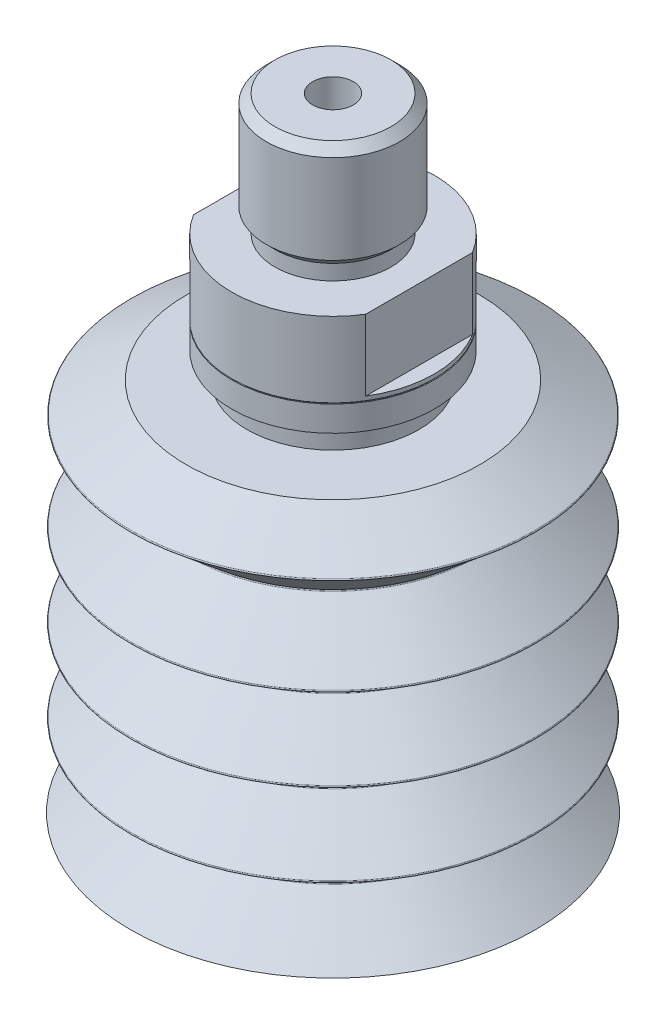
ISO-10303-21;
HEADER;
FILE_DESCRIPTION(('STEP AP214'),'2;1');
FILE_NAME('part.step','',(''),(''),'','','');
FILE_SCHEMA(('AUTOMOTIVE_DESIGN { 1 0 10303 214 1 1 1 1 }'));
ENDSEC;
DATA;
#1=APPLICATION_CONTEXT('core data for automotive mechanical design processes');
#2=APPLICATION_PROTOCOL_DEFINITION('international standard','automotive_design',2000,#1);
#3=PRODUCT_CONTEXT('',#1,'mechanical');
#4=PRODUCT('Part','Part','',(#3));
#5=PRODUCT_RELATED_PRODUCT_CATEGORY('part','',(#4));
#6=PRODUCT_DEFINITION_FORMATION('','',#4);
#7=PRODUCT_DEFINITION_CONTEXT('part definition',#1,'design');
#8=PRODUCT_DEFINITION('design','',#6,#7);
#9=PRODUCT_DEFINITION_SHAPE('','',#8);
#10=(LENGTH_UNIT() NAMED_UNIT(*) SI_UNIT(.MILLI.,.METRE.));
#11=(NAMED_UNIT(*) PLANE_ANGLE_UNIT() SI_UNIT($,.RADIAN.));
#12=(NAMED_UNIT(*) SI_UNIT($,.STERADIAN.) SOLID_ANGLE_UNIT());
#13=UNCERTAINTY_MEASURE_WITH_UNIT(LENGTH_MEASURE(1.E-05),#10,'distance_accuracy_value','');
#14=(GEOMETRIC_REPRESENTATION_CONTEXT(3) GLOBAL_UNCERTAINTY_ASSIGNED_CONTEXT((#13)) GLOBAL_UNIT_ASSIGNED_CONTEXT((#10,
#11,#12)) REPRESENTATION_CONTEXT('',''));
#15=CARTESIAN_POINT('',(0.,0.,0.));
#16=DIRECTION('',(0.,0.,1.));
#17=DIRECTION('',(1.,0.,0.));
#18=AXIS2_PLACEMENT_3D('',#15,#16,#17);
#19=CARTESIAN_POINT('',(-8.5,49.5,-12.));
#20=DIRECTION('',(1.,0.,0.));
#21=DIRECTION('',(0.,1.,0.));
#22=AXIS2_PLACEMENT_3D('',#19,#20,#21);
#23=PLANE('',#22);
#24=DIRECTION('',(0.,1.,0.));
#25=VECTOR('',#24,1.);
#26=CARTESIAN_POINT('',(-8.5,42.,5.26782687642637));
#27=LINE('',#26,#25);
#28=CARTESIAN_POINT('',(-8.5,42.5,5.26782687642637));
#29=VERTEX_POINT('',#28);
#30=CARTESIAN_POINT('',(-8.5,49.5,5.26782687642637));
#31=VERTEX_POINT('',#30);
#32=EDGE_CURVE('E337',#29,#31,#27,.T.);
#33=ORIENTED_EDGE('',*,*,#32,.T.);
#34=DIRECTION('',(0.,0.,-1.));
#35=VECTOR('',#34,1.);
#36=CARTESIAN_POINT('',(-8.5,49.5,0.));
#37=LINE('',#36,#35);
#38=CARTESIAN_POINT('',(-8.5,49.5,-5.26782687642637));
#39=VERTEX_POINT('',#38);
#40=EDGE_CURVE('E278',#31,#39,#37,.T.);
#41=ORIENTED_EDGE('',*,*,#40,.T.);
#42=DIRECTION('',(0.,-1.,0.));
#43=VECTOR('',#42,1.);
#44=CARTESIAN_POINT('',(-8.5,42.,-5.26782687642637));
#45=LINE('',#44,#43);
#46=CARTESIAN_POINT('',(-8.5,42.5,-5.26782687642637));
#47=VERTEX_POINT('',#46);
#48=EDGE_CURVE('E346',#39,#47,#45,.T.);
#49=ORIENTED_EDGE('',*,*,#48,.T.);
#50=DIRECTION('',(0.,0.,1.));
#51=VECTOR('',#50,1.);
#52=CARTESIAN_POINT('',(-8.5,42.5,-12.));
#53=LINE('',#52,#51);
#54=EDGE_CURVE('E10',#47,#29,#53,.T.);
#55=ORIENTED_EDGE('',*,*,#54,.T.);
#56=EDGE_LOOP('',(#33,#41,#49,#55));
#57=FACE_BOUND('',#56,.T.);
#58=ADVANCED_FACE('F16',(#57),#23,.F.);
#59=CARTESIAN_POINT('',(0.,42.5,0.));
#60=DIRECTION('',(0.,1.,0.));
#61=DIRECTION('',(1.,0.,0.));
#62=AXIS2_PLACEMENT_3D('',#59,#60,#61);
#63=PLANE('',#62);
#64=ORIENTED_EDGE('',*,*,#54,.F.);
#65=CARTESIAN_POINT('',(0.,42.5,0.));
#66=DIRECTION('',(0.,-1.,0.));
#67=DIRECTION('',(0.,0.,1.));
#68=AXIS2_PLACEMENT_3D('',#65,#66,#67);
#69=CIRCLE('',#68,10.);
#70=EDGE_CURVE('E343',#29,#47,#69,.T.);
#71=ORIENTED_EDGE('',*,*,#70,.F.);
#72=EDGE_LOOP('',(#64,#71));
#73=FACE_BOUND('',#72,.T.);
#74=ADVANCED_FACE('F478',(#73),#63,.T.);
#75=CARTESIAN_POINT('',(0.,42.5,0.));
#76=DIRECTION('',(0.,1.,0.));
#77=DIRECTION('',(1.,0.,0.));
#78=AXIS2_PLACEMENT_3D('',#75,#76,#77);
#79=PLANE('',#78);
#80=DIRECTION('',(0.,0.,-1.));
#81=VECTOR('',#80,1.);
#82=CARTESIAN_POINT('',(8.5,42.5,12.));
#83=LINE('',#82,#81);
#84=CARTESIAN_POINT('',(8.5,42.5,5.26782687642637));
#85=VERTEX_POINT('',#84);
#86=CARTESIAN_POINT('',(8.5,42.5,-5.26782687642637));
#87=VERTEX_POINT('',#86);
#88=EDGE_CURVE('E27',#85,#87,#83,.T.);
#89=ORIENTED_EDGE('',*,*,#88,.F.);
#90=CARTESIAN_POINT('',(0.,42.5,0.));
#91=DIRECTION('',(0.,-1.,0.));
#92=DIRECTION('',(0.,0.,1.));
#93=AXIS2_PLACEMENT_3D('',#90,#91,#92);
#94=CIRCLE('',#93,10.);
#95=EDGE_CURVE('E383',#87,#85,#94,.T.);
#96=ORIENTED_EDGE('',*,*,#95,.F.);
#97=EDGE_LOOP('',(#89,#96));
#98=FACE_BOUND('',#97,.T.);
#99=ADVANCED_FACE('F483',(#98),#79,.T.);
#100=CARTESIAN_POINT('',(8.5,49.5,12.));
#101=DIRECTION('',(-1.,0.,0.));
#102=DIRECTION('',(0.,0.,1.));
#103=AXIS2_PLACEMENT_3D('',#100,#101,#102);
#104=PLANE('',#103);
#105=DIRECTION('',(0.,1.,0.));
#106=VECTOR('',#105,1.);
#107=CARTESIAN_POINT('',(8.5,42.,-5.26782687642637));
#108=LINE('',#107,#106);
#109=CARTESIAN_POINT('',(8.5,49.5,-5.26782687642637));
#110=VERTEX_POINT('',#109);
#111=EDGE_CURVE('E330',#87,#110,#108,.T.);
#112=ORIENTED_EDGE('',*,*,#111,.T.);
#113=DIRECTION('',(0.,0.,1.));
#114=VECTOR('',#113,1.);
#115=CARTESIAN_POINT('',(8.5,49.5,0.));
#116=LINE('',#115,#114);
#117=CARTESIAN_POINT('',(8.5,49.5,5.26782687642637));
#118=VERTEX_POINT('',#117);
#119=EDGE_CURVE('E342',#110,#118,#116,.T.);
#120=ORIENTED_EDGE('',*,*,#119,.T.);
#121=DIRECTION('',(0.,-1.,0.));
#122=VECTOR('',#121,1.);
#123=CARTESIAN_POINT('',(8.5,42.,5.26782687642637));
#124=LINE('',#123,#122);
#125=EDGE_CURVE('E338',#118,#85,#124,.T.);
#126=ORIENTED_EDGE('',*,*,#125,.T.);
#127=ORIENTED_EDGE('',*,*,#88,.T.);
#128=EDGE_LOOP('',(#112,#120,#126,#127));
#129=FACE_BOUND('',#128,.T.);
#130=ADVANCED_FACE('F552',(#129),#104,.F.);
#131=CARTESIAN_POINT('',(0.,60.644,0.));
#132=DIRECTION('',(0.,-1.,0.));
#133=DIRECTION('',(0.,0.,-1.));
#134=AXIS2_PLACEMENT_3D('',#131,#132,#133);
#135=CONICAL_SURFACE('',#134,6.5785,0.785398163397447);
#136=CARTESIAN_POINT('',(0.,60.644,0.));
#137=DIRECTION('',(0.,-1.,0.));
#138=DIRECTION('',(0.,0.,-1.));
#139=AXIS2_PLACEMENT_3D('',#136,#137,#138);
#140=CIRCLE('',#139,6.5785);
#141=CARTESIAN_POINT('',(0.,60.644,-6.5785));
#142=VERTEX_POINT('',#141);
#143=EDGE_CURVE('E39',#142,#142,#140,.T.);
#144=ORIENTED_EDGE('',*,*,#143,.F.);
#145=EDGE_LOOP('',(#144));
#146=FACE_BOUND('',#145,.T.);
#147=CARTESIAN_POINT('',(0.,61.5,0.));
#148=DIRECTION('',(0.,-1.,0.));
#149=DIRECTION('',(0.,0.,-1.));
#150=AXIS2_PLACEMENT_3D('',#147,#148,#149);
#151=CIRCLE('',#150,5.7225);
#152=CARTESIAN_POINT('',(0.,61.5,-5.7225));
#153=VERTEX_POINT('',#152);
#154=EDGE_CURVE('E236',#153,#153,#151,.T.);
#155=ORIENTED_EDGE('',*,*,#154,.T.);
#156=EDGE_LOOP('',(#155));
#157=FACE_BOUND('',#156,.T.);
#158=ADVANCED_FACE('F548',(#146,#157),#135,.T.);
#159=CARTESIAN_POINT('',(0.,42.,0.));
#160=DIRECTION('',(0.,-1.,0.));
#161=DIRECTION('',(0.,0.,-1.));
#162=AXIS2_PLACEMENT_3D('',#159,#160,#161);
#163=CYLINDRICAL_SURFACE('',#162,6.5785);
#164=CARTESIAN_POINT('',(0.,51.856,0.));
#165=DIRECTION('',(0.,-1.,0.));
#166=DIRECTION('',(0.,0.,-1.));
#167=AXIS2_PLACEMENT_3D('',#164,#165,#166);
#168=CIRCLE('',#167,6.5785);
#169=CARTESIAN_POINT('',(0.,51.856,-6.5785));
#170=VERTEX_POINT('',#169);
#171=EDGE_CURVE('E281',#170,#170,#168,.T.);
#172=ORIENTED_EDGE('',*,*,#171,.F.);
#173=EDGE_LOOP('',(#172));
#174=FACE_BOUND('',#173,.T.);
#175=ORIENTED_EDGE('',*,*,#143,.T.);
#176=EDGE_LOOP('',(#175));
#177=FACE_BOUND('',#176,.T.);
#178=ADVANCED_FACE('F551',(#174,#177),#163,.T.);
#179=CARTESIAN_POINT('',(0.,51.,0.));
#180=DIRECTION('',(0.,1.,0.));
#181=DIRECTION('',(0.,0.,1.));
#182=AXIS2_PLACEMENT_3D('',#179,#180,#181);
#183=CONICAL_SURFACE('',#182,5.7225,0.785398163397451);
#184=CARTESIAN_POINT('',(0.,51.,0.));
#185=DIRECTION('',(0.,-1.,0.));
#186=DIRECTION('',(0.,0.,-1.));
#187=AXIS2_PLACEMENT_3D('',#184,#185,#186);
#188=CIRCLE('',#187,5.7225);
#189=CARTESIAN_POINT('',(0.,51.,-5.7225));
#190=VERTEX_POINT('',#189);
#191=EDGE_CURVE('E339',#190,#190,#188,.T.);
#192=ORIENTED_EDGE('',*,*,#191,.F.);
#193=EDGE_LOOP('',(#192));
#194=FACE_BOUND('',#193,.T.);
#195=ORIENTED_EDGE('',*,*,#171,.T.);
#196=EDGE_LOOP('',(#195));
#197=FACE_BOUND('',#196,.T.);
#198=ADVANCED_FACE('F493',(#194,#197),#183,.T.);
#199=CARTESIAN_POINT('',(0.,42.,0.));
#200=DIRECTION('',(0.,-1.,0.));
#201=DIRECTION('',(0.,0.,-1.));
#202=AXIS2_PLACEMENT_3D('',#199,#200,#201);
#203=CYLINDRICAL_SURFACE('',#202,5.7225);
#204=CARTESIAN_POINT('',(0.,49.5,0.));
#205=DIRECTION('',(0.,-1.,0.));
#206=DIRECTION('',(0.,0.,-1.));
#207=AXIS2_PLACEMENT_3D('',#204,#205,#206);
#208=CIRCLE('',#207,5.7225);
#209=CARTESIAN_POINT('',(0.,49.5,-5.7225));
#210=VERTEX_POINT('',#209);
#211=EDGE_CURVE('E274',#210,#210,#208,.T.);
#212=ORIENTED_EDGE('',*,*,#211,.F.);
#213=EDGE_LOOP('',(#212));
#214=FACE_BOUND('',#213,.T.);
#215=ORIENTED_EDGE('',*,*,#191,.T.);
#216=EDGE_LOOP('',(#215));
#217=FACE_BOUND('',#216,.T.);
#218=ADVANCED_FACE('F489',(#214,#217),#203,.T.);
#219=CARTESIAN_POINT('',(10.,49.5,0.));
#220=DIRECTION('',(0.,1.,0.));
#221=DIRECTION('',(1.,0.,0.));
#222=AXIS2_PLACEMENT_3D('',#219,#220,#221);
#223=PLANE('',#222);
#224=ORIENTED_EDGE('',*,*,#40,.F.);
#225=CARTESIAN_POINT('',(0.,49.5,0.));
#226=DIRECTION('',(0.,-1.,0.));
#227=DIRECTION('',(0.,0.,-1.));
#228=AXIS2_PLACEMENT_3D('',#225,#226,#227);
#229=CIRCLE('',#228,10.);
#230=EDGE_CURVE('E333',#118,#31,#229,.T.);
#231=ORIENTED_EDGE('',*,*,#230,.F.);
#232=ORIENTED_EDGE('',*,*,#119,.F.);
#233=CARTESIAN_POINT('',(0.,49.5,0.));
#234=DIRECTION('',(0.,-1.,0.));
#235=DIRECTION('',(0.,0.,-1.));
#236=AXIS2_PLACEMENT_3D('',#233,#234,#235);
#237=CIRCLE('',#236,10.);
#238=EDGE_CURVE('E279',#39,#110,#237,.T.);
#239=ORIENTED_EDGE('',*,*,#238,.F.);
#240=EDGE_LOOP('',(#224,#231,#232,#239));
#241=FACE_BOUND('',#240,.T.);
#242=ORIENTED_EDGE('',*,*,#211,.T.);
#243=EDGE_LOOP('',(#242));
#244=FACE_BOUND('',#243,.T.);
#245=ADVANCED_FACE('F492',(#241,#244),#223,.T.);
#246=CARTESIAN_POINT('',(0.,42.,0.));
#247=DIRECTION('',(0.,-1.,0.));
#248=DIRECTION('',(0.,0.,-1.));
#249=AXIS2_PLACEMENT_3D('',#246,#247,#248);
#250=CYLINDRICAL_SURFACE('',#249,10.);
#251=CARTESIAN_POINT('',(0.,42.1,0.));
#252=DIRECTION('',(0.,-1.,0.));
#253=DIRECTION('',(0.,0.,-1.));
#254=AXIS2_PLACEMENT_3D('',#251,#252,#253);
#255=CIRCLE('',#254,10.);
#256=CARTESIAN_POINT('',(0.,42.1,-10.));
#257=VERTEX_POINT('',#256);
#258=EDGE_CURVE('E239',#257,#257,#255,.T.);
#259=ORIENTED_EDGE('',*,*,#258,.F.);
#260=EDGE_LOOP('',(#259));
#261=FACE_BOUND('',#260,.T.);
#262=ORIENTED_EDGE('',*,*,#111,.F.);
#263=ORIENTED_EDGE('',*,*,#95,.T.);
#264=ORIENTED_EDGE('',*,*,#125,.F.);
#265=ORIENTED_EDGE('',*,*,#230,.T.);
#266=ORIENTED_EDGE('',*,*,#32,.F.);
#267=ORIENTED_EDGE('',*,*,#70,.T.);
#268=ORIENTED_EDGE('',*,*,#48,.F.);
#269=ORIENTED_EDGE('',*,*,#238,.T.);
#270=EDGE_LOOP('',(#262,#263,#264,#265,#266,#267,#268,#269));
#271=FACE_BOUND('',#270,.T.);
#272=ADVANCED_FACE('F732',(#261,#271),#250,.T.);
#273=CARTESIAN_POINT('',(0.,42.,0.));
#274=DIRECTION('',(0.,1.,0.));
#275=DIRECTION('',(0.,0.,1.));
#276=AXIS2_PLACEMENT_3D('',#273,#274,#275);
#277=CONICAL_SURFACE('',#276,9.9,0.785398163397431);
#278=CARTESIAN_POINT('',(0.,42.,0.));
#279=DIRECTION('',(0.,-1.,0.));
#280=DIRECTION('',(0.,0.,-1.));
#281=AXIS2_PLACEMENT_3D('',#278,#279,#280);
#282=CIRCLE('',#281,9.9);
#283=CARTESIAN_POINT('',(0.,42.,-9.9));
#284=VERTEX_POINT('',#283);
#285=EDGE_CURVE('E323',#284,#284,#282,.T.);
#286=ORIENTED_EDGE('',*,*,#285,.F.);
#287=EDGE_LOOP('',(#286));
#288=FACE_BOUND('',#287,.T.);
#289=ORIENTED_EDGE('',*,*,#258,.T.);
#290=EDGE_LOOP('',(#289));
#291=FACE_BOUND('',#290,.T.);
#292=ADVANCED_FACE('F734',(#288,#291),#277,.T.);
#293=CARTESIAN_POINT('',(0.,42.,0.));
#294=DIRECTION('',(0.,-1.,0.));
#295=DIRECTION('',(0.,0.,-1.));
#296=AXIS2_PLACEMENT_3D('',#293,#294,#295);
#297=CYLINDRICAL_SURFACE('',#296,2.);
#298=CARTESIAN_POINT('',(0.,61.5,0.));
#299=DIRECTION('',(0.,-1.,0.));
#300=DIRECTION('',(0.,0.,-1.));
#301=AXIS2_PLACEMENT_3D('',#298,#299,#300);
#302=CIRCLE('',#301,2.);
#303=CARTESIAN_POINT('',(0.,61.5,-2.));
#304=VERTEX_POINT('',#303);
#305=EDGE_CURVE('E240',#304,#304,#302,.T.);
#306=ORIENTED_EDGE('',*,*,#305,.F.);
#307=EDGE_LOOP('',(#306));
#308=FACE_BOUND('',#307,.T.);
#309=CARTESIAN_POINT('',(0.,42.,0.));
#310=DIRECTION('',(0.,-1.,0.));
#311=DIRECTION('',(0.,0.,-1.));
#312=AXIS2_PLACEMENT_3D('',#309,#310,#311);
#313=CIRCLE('',#312,2.);
#314=CARTESIAN_POINT('',(0.,42.,-2.));
#315=VERTEX_POINT('',#314);
#316=EDGE_CURVE('E314',#315,#315,#313,.T.);
#317=ORIENTED_EDGE('',*,*,#316,.T.);
#318=EDGE_LOOP('',(#317));
#319=FACE_BOUND('',#318,.T.);
#320=ADVANCED_FACE('F770',(#308,#319),#297,.F.);
#321=CARTESIAN_POINT('',(5.7225,61.5,0.));
#322=DIRECTION('',(0.,1.,0.));
#323=DIRECTION('',(1.,0.,0.));
#324=AXIS2_PLACEMENT_3D('',#321,#322,#323);
#325=PLANE('',#324);
#326=ORIENTED_EDGE('',*,*,#154,.F.);
#327=EDGE_LOOP('',(#326));
#328=FACE_BOUND('',#327,.T.);
#329=ORIENTED_EDGE('',*,*,#305,.T.);
#330=EDGE_LOOP('',(#329));
#331=FACE_BOUND('',#330,.T.);
#332=ADVANCED_FACE('F530',(#328,#331),#325,.T.);
#333=CARTESIAN_POINT('',(2.,42.,0.));
#334=DIRECTION('',(0.,-1.,0.));
#335=DIRECTION('',(0.,0.,-1.));
#336=AXIS2_PLACEMENT_3D('',#333,#334,#335);
#337=PLANE('',#336);
#338=ORIENTED_EDGE('',*,*,#316,.F.);
#339=EDGE_LOOP('',(#338));
#340=FACE_BOUND('',#339,.T.);
#341=CARTESIAN_POINT('',(0.,42.,0.));
#342=DIRECTION('',(0.,-1.,0.));
#343=DIRECTION('',(0.,0.,-1.));
#344=AXIS2_PLACEMENT_3D('',#341,#342,#343);
#345=CIRCLE('',#344,3.25);
#346=CARTESIAN_POINT('',(0.,42.,-3.25));
#347=VERTEX_POINT('',#346);
#348=EDGE_CURVE('E320',#347,#347,#345,.T.);
#349=ORIENTED_EDGE('',*,*,#348,.T.);
#350=EDGE_LOOP('',(#349));
#351=FACE_BOUND('',#350,.T.);
#352=ADVANCED_FACE('F526',(#340,#351),#337,.T.);
#353=CARTESIAN_POINT('',(0.,0.,0.));
#354=DIRECTION('',(0.,-1.,0.));
#355=DIRECTION('',(0.,0.,-1.));
#356=AXIS2_PLACEMENT_3D('',#353,#354,#355);
#357=CYLINDRICAL_SURFACE('',#356,3.25);
#358=ORIENTED_EDGE('',*,*,#348,.F.);
#359=EDGE_LOOP('',(#358));
#360=FACE_BOUND('',#359,.T.);
#361=CARTESIAN_POINT('',(0.,39.5,0.));
#362=DIRECTION('',(0.,-1.,0.));
#363=DIRECTION('',(0.,0.,-1.));
#364=AXIS2_PLACEMENT_3D('',#361,#362,#363);
#365=CIRCLE('',#364,3.25);
#366=CARTESIAN_POINT('',(0.,39.5,-3.25));
#367=VERTEX_POINT('',#366);
#368=EDGE_CURVE('E254',#367,#367,#365,.T.);
#369=ORIENTED_EDGE('',*,*,#368,.T.);
#370=EDGE_LOOP('',(#369));
#371=FACE_BOUND('',#370,.T.);
#372=ADVANCED_FACE('F529',(#360,#371),#357,.F.);
#373=CARTESIAN_POINT('',(10.,42.,0.));
#374=DIRECTION('',(0.,1.,0.));
#375=DIRECTION('',(1.,0.,0.));
#376=AXIS2_PLACEMENT_3D('',#373,#374,#375);
#377=PLANE('',#376);
#378=CARTESIAN_POINT('',(0.,42.,0.));
#379=DIRECTION('',(0.,-1.,0.));
#380=DIRECTION('',(0.,0.,-1.));
#381=AXIS2_PLACEMENT_3D('',#378,#379,#380);
#382=CIRCLE('',#381,10.);
#383=CARTESIAN_POINT('',(0.,42.,-10.));
#384=VERTEX_POINT('',#383);
#385=EDGE_CURVE('E319',#384,#384,#382,.T.);
#386=ORIENTED_EDGE('',*,*,#385,.F.);
#387=EDGE_LOOP('',(#386));
#388=FACE_BOUND('',#387,.T.);
#389=ORIENTED_EDGE('',*,*,#285,.T.);
#390=EDGE_LOOP('',(#389));
#391=FACE_BOUND('',#390,.T.);
#392=ADVANCED_FACE('F609',(#388,#391),#377,.T.);
#393=CARTESIAN_POINT('',(0.,0.,0.));
#394=DIRECTION('',(0.,-1.,0.));
#395=DIRECTION('',(0.,0.,-1.));
#396=AXIS2_PLACEMENT_3D('',#393,#394,#395);
#397=CYLINDRICAL_SURFACE('',#396,10.);
#398=CARTESIAN_POINT('',(0.,39.5,0.));
#399=DIRECTION('',(0.,-1.,0.));
#400=DIRECTION('',(0.,0.,-1.));
#401=AXIS2_PLACEMENT_3D('',#398,#399,#400);
#402=CIRCLE('',#401,10.);
#403=CARTESIAN_POINT('',(0.,39.5,-10.));
#404=VERTEX_POINT('',#403);
#405=EDGE_CURVE('E315',#404,#404,#402,.T.);
#406=ORIENTED_EDGE('',*,*,#405,.F.);
#407=EDGE_LOOP('',(#406));
#408=FACE_BOUND('',#407,.T.);
#409=ORIENTED_EDGE('',*,*,#385,.T.);
#410=EDGE_LOOP('',(#409));
#411=FACE_BOUND('',#410,.T.);
#412=ADVANCED_FACE('F524',(#408,#411),#397,.T.);
#413=CARTESIAN_POINT('',(8.5,39.5,0.));
#414=DIRECTION('',(0.,-1.,0.));
#415=DIRECTION('',(0.,0.,-1.));
#416=AXIS2_PLACEMENT_3D('',#413,#414,#415);
#417=PLANE('',#416);
#418=CARTESIAN_POINT('',(0.,39.5,0.));
#419=DIRECTION('',(0.,-1.,0.));
#420=DIRECTION('',(0.,0.,-1.));
#421=AXIS2_PLACEMENT_3D('',#418,#419,#420);
#422=CIRCLE('',#421,8.5);
#423=CARTESIAN_POINT('',(0.,39.5,-8.5));
#424=VERTEX_POINT('',#423);
#425=EDGE_CURVE('E306',#424,#424,#422,.T.);
#426=ORIENTED_EDGE('',*,*,#425,.F.);
#427=EDGE_LOOP('',(#426));
#428=FACE_BOUND('',#427,.T.);
#429=ORIENTED_EDGE('',*,*,#405,.T.);
#430=EDGE_LOOP('',(#429));
#431=FACE_BOUND('',#430,.T.);
#432=ADVANCED_FACE('F520',(#428,#431),#417,.T.);
#433=CARTESIAN_POINT('',(0.,0.,0.));
#434=DIRECTION('',(0.,-1.,0.));
#435=DIRECTION('',(0.,0.,-1.));
#436=AXIS2_PLACEMENT_3D('',#433,#434,#435);
#437=CYLINDRICAL_SURFACE('',#436,8.5);
#438=CARTESIAN_POINT('',(0.,37.,0.));
#439=DIRECTION('',(0.,-1.,0.));
#440=DIRECTION('',(0.,0.,-1.));
#441=AXIS2_PLACEMENT_3D('',#438,#439,#440);
#442=CIRCLE('',#441,8.5);
#443=CARTESIAN_POINT('',(0.,37.,-8.5));
#444=VERTEX_POINT('',#443);
#445=EDGE_CURVE('E302',#444,#444,#442,.T.);
#446=ORIENTED_EDGE('',*,*,#445,.F.);
#447=EDGE_LOOP('',(#446));
#448=FACE_BOUND('',#447,.T.);
#449=ORIENTED_EDGE('',*,*,#425,.T.);
#450=EDGE_LOOP('',(#449));
#451=FACE_BOUND('',#450,.T.);
#452=ADVANCED_FACE('F523',(#448,#451),#437,.T.);
#453=CARTESIAN_POINT('',(14.5,37.,0.));
#454=DIRECTION('',(0.,1.,0.));
#455=DIRECTION('',(1.,0.,0.));
#456=AXIS2_PLACEMENT_3D('',#453,#454,#455);
#457=PLANE('',#456);
#458=CARTESIAN_POINT('',(0.,37.,0.));
#459=DIRECTION('',(0.,-1.,0.));
#460=DIRECTION('',(0.,0.,-1.));
#461=AXIS2_PLACEMENT_3D('',#458,#459,#460);
#462=CIRCLE('',#461,14.5);
#463=CARTESIAN_POINT('',(0.,37.,-14.5));
#464=VERTEX_POINT('',#463);
#465=EDGE_CURVE('E307',#464,#464,#462,.T.);
#466=ORIENTED_EDGE('',*,*,#465,.F.);
#467=EDGE_LOOP('',(#466));
#468=FACE_BOUND('',#467,.T.);
#469=ORIENTED_EDGE('',*,*,#445,.T.);
#470=EDGE_LOOP('',(#469));
#471=FACE_BOUND('',#470,.T.);
#472=ADVANCED_FACE('F546',(#468,#471),#457,.T.);
#473=CARTESIAN_POINT('',(0.,34.0458904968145,0.));
#474=DIRECTION('',(0.,-1.,0.));
#475=DIRECTION('',(0.,0.,-1.));
#476=AXIS2_PLACEMENT_3D('',#473,#474,#475);
#477=CONICAL_SURFACE('',#476,19.8720425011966,1.06802655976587);
#478=CARTESIAN_POINT('',(0.,34.0458904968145,0.));
#479=DIRECTION('',(0.,-1.,0.));
#480=DIRECTION('',(0.,0.,-1.));
#481=AXIS2_PLACEMENT_3D('',#478,#479,#480);
#482=CIRCLE('',#481,19.8720425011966);
#483=CARTESIAN_POINT('',(0.,34.0458904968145,-19.8720425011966));
#484=VERTEX_POINT('',#483);
#485=EDGE_CURVE('E20',#484,#484,#482,.T.);
#486=ORIENTED_EDGE('',*,*,#485,.F.);
#487=EDGE_LOOP('',(#486));
#488=FACE_BOUND('',#487,.T.);
#489=ORIENTED_EDGE('',*,*,#465,.T.);
#490=EDGE_LOOP('',(#489));
#491=FACE_BOUND('',#490,.T.);
#492=ADVANCED_FACE('F538',(#488,#491),#477,.T.);
#493=CARTESIAN_POINT('',(0.,33.958265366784,0.));
#494=DIRECTION('',(0.,-1.,0.));
#495=DIRECTION('',(0.,0.,-1.));
#496=AXIS2_PLACEMENT_3D('',#493,#494,#495);
#497=TOROIDAL_SURFACE('',#496,19.8238570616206,0.0999999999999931);
#498=CARTESIAN_POINT('',(0.,33.8816609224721,0.));
#499=DIRECTION('',(0.,-1.,0.));
#500=DIRECTION('',(0.,0.,-1.));
#501=AXIS2_PLACEMENT_3D('',#498,#499,#500);
#502=CIRCLE('',#501,19.8881358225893);
#503=CARTESIAN_POINT('',(0.,33.8816609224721,-19.8881358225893));
#504=VERTEX_POINT('',#503);
#505=EDGE_CURVE('E347',#504,#504,#502,.T.);
#506=ORIENTED_EDGE('',*,*,#505,.F.);
#507=EDGE_LOOP('',(#506));
#508=FACE_BOUND('',#507,.T.);
#509=ORIENTED_EDGE('',*,*,#485,.T.);
#510=EDGE_LOOP('',(#509));
#511=FACE_BOUND('',#510,.T.);
#512=ADVANCED_FACE('F535',(#508,#511),#497,.T.);
#513=CARTESIAN_POINT('',(0.,29.1194322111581,0.));
#514=DIRECTION('',(0.,1.,0.));
#515=DIRECTION('',(0.,0.,1.));
#516=AXIS2_PLACEMENT_3D('',#513,#514,#515);
#517=CONICAL_SURFACE('',#516,14.2127326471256,0.872664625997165);
#518=CARTESIAN_POINT('',(0.,29.1194322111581,0.));
#519=DIRECTION('',(0.,-1.,0.));
#520=DIRECTION('',(0.,0.,-1.));
#521=AXIS2_PLACEMENT_3D('',#518,#519,#520);
#522=CIRCLE('',#521,14.2127326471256);
#523=CARTESIAN_POINT('',(0.,29.1194322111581,-14.2127326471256));
#524=VERTEX_POINT('',#523);
#525=EDGE_CURVE('E349',#524,#524,#522,.T.);
#526=ORIENTED_EDGE('',*,*,#525,.F.);
#527=EDGE_LOOP('',(#526));
#528=FACE_BOUND('',#527,.T.);
#529=ORIENTED_EDGE('',*,*,#505,.T.);
#530=EDGE_LOOP('',(#529));
#531=FACE_BOUND('',#530,.T.);
#532=ADVANCED_FACE('F18',(#528,#531),#517,.T.);
#533=CARTESIAN_POINT('',(0.,29.0428277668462,0.));
#534=DIRECTION('',(0.,-1.,0.));
#535=DIRECTION('',(0.,0.,-1.));
#536=AXIS2_PLACEMENT_3D('',#533,#534,#535);
#537=TOROIDAL_SURFACE('',#536,14.2770114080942,0.0999999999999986);
#538=ORIENTED_EDGE('',*,*,#525,.T.);
#539=EDGE_LOOP('',(#538));
#540=FACE_BOUND('',#539,.T.);
#541=CARTESIAN_POINT('',(0.,28.9640266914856,0.));
#542=DIRECTION('',(0.,-1.,0.));
#543=DIRECTION('',(0.,0.,-1.));
#544=AXIS2_PLACEMENT_3D('',#541,#542,#543);
#545=CIRCLE('',#544,14.2154452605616);
#546=CARTESIAN_POINT('',(0.,28.9640266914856,-14.2154452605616));
#547=VERTEX_POINT('',#546);
#548=EDGE_CURVE('E229',#547,#547,#545,.T.);
#549=ORIENTED_EDGE('',*,*,#548,.F.);
#550=EDGE_LOOP('',(#549));
#551=FACE_BOUND('',#550,.T.);
#552=ADVANCED_FACE('F518',(#540,#551),#537,.F.);
#553=CARTESIAN_POINT('',(0.,24.5278390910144,0.));
#554=DIRECTION('',(0.,-1.,0.));
#555=DIRECTION('',(0.,0.,-1.));
#556=AXIS2_PLACEMENT_3D('',#553,#554,#555);
#557=CONICAL_SURFACE('',#556,19.8935064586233,0.907571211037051);
#558=CARTESIAN_POINT('',(0.,24.5278390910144,0.));
#559=DIRECTION('',(0.,-1.,0.));
#560=DIRECTION('',(0.,0.,-1.));
#561=AXIS2_PLACEMENT_3D('',#558,#559,#560);
#562=CIRCLE('',#561,19.8935064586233);
#563=CARTESIAN_POINT('',(0.,24.5278390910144,-19.8935064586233));
#564=VERTEX_POINT('',#563);
#565=EDGE_CURVE('E241',#564,#564,#562,.T.);
#566=ORIENTED_EDGE('',*,*,#565,.F.);
#567=EDGE_LOOP('',(#566));
#568=FACE_BOUND('',#567,.T.);
#569=ORIENTED_EDGE('',*,*,#548,.T.);
#570=EDGE_LOOP('',(#569));
#571=FACE_BOUND('',#570,.T.);
#572=ADVANCED_FACE('F514',(#568,#571),#557,.T.);
#573=CARTESIAN_POINT('',(0.,24.4490380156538,0.));
#574=DIRECTION('',(0.,-1.,0.));
#575=DIRECTION('',(0.,0.,-1.));
#576=AXIS2_PLACEMENT_3D('',#573,#574,#575);
#577=TOROIDAL_SURFACE('',#576,19.8319403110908,0.1);
#578=CARTESIAN_POINT('',(0.,24.3671228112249,0.));
#579=DIRECTION('',(0.,-1.,0.));
#580=DIRECTION('',(0.,0.,-1.));
#581=AXIS2_PLACEMENT_3D('',#578,#579,#580);
#582=CIRCLE('',#581,19.8892979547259);
#583=CARTESIAN_POINT('',(0.,24.3671228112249,-19.8892979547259));
#584=VERTEX_POINT('',#583);
#585=EDGE_CURVE('E244',#584,#584,#582,.T.);
#586=ORIENTED_EDGE('',*,*,#585,.F.);
#587=EDGE_LOOP('',(#586));
#588=FACE_BOUND('',#587,.T.);
#589=ORIENTED_EDGE('',*,*,#565,.T.);
#590=EDGE_LOOP('',(#589));
#591=FACE_BOUND('',#590,.T.);
#592=ADVANCED_FACE('F517',(#588,#591),#577,.T.);
#593=CARTESIAN_POINT('',(0.,20.6710101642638,0.));
#594=DIRECTION('',(0.,1.,0.));
#595=DIRECTION('',(0.,0.,1.));
#596=AXIS2_PLACEMENT_3D('',#593,#594,#595);
#597=CONICAL_SURFACE('',#596,14.6107020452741,0.959931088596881);
#598=CARTESIAN_POINT('',(0.,20.6710101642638,0.));
#599=DIRECTION('',(0.,-1.,0.));
#600=DIRECTION('',(0.,0.,-1.));
#601=AXIS2_PLACEMENT_3D('',#598,#599,#600);
#602=CIRCLE('',#601,14.6107020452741);
#603=CARTESIAN_POINT('',(0.,20.6710101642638,-14.6107020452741));
#604=VERTEX_POINT('',#603);
#605=EDGE_CURVE('E268',#604,#604,#602,.T.);
#606=ORIENTED_EDGE('',*,*,#605,.F.);
#607=EDGE_LOOP('',(#606));
#608=FACE_BOUND('',#607,.T.);
#609=ORIENTED_EDGE('',*,*,#585,.T.);
#610=EDGE_LOOP('',(#609));
#611=FACE_BOUND('',#610,.T.);
#612=ADVANCED_FACE('F542',(#608,#611),#597,.T.);
#613=CARTESIAN_POINT('',(0.,20.5890949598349,0.));
#614=DIRECTION('',(0.,-1.,0.));
#615=DIRECTION('',(0.,0.,-1.));
#616=AXIS2_PLACEMENT_3D('',#613,#614,#615);
#617=TOROIDAL_SURFACE('',#616,14.6680596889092,0.100000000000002);
#618=ORIENTED_EDGE('',*,*,#605,.T.);
#619=EDGE_LOOP('',(#618));
#620=FACE_BOUND('',#619,.T.);
#621=CARTESIAN_POINT('',(0.,20.5102938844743,0.));
#622=DIRECTION('',(0.,-1.,0.));
#623=DIRECTION('',(0.,0.,-1.));
#624=AXIS2_PLACEMENT_3D('',#621,#622,#623);
#625=CIRCLE('',#624,14.6064935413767);
#626=CARTESIAN_POINT('',(0.,20.5102938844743,-14.6064935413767));
#627=VERTEX_POINT('',#626);
#628=EDGE_CURVE('E265',#627,#627,#625,.T.);
#629=ORIENTED_EDGE('',*,*,#628,.F.);
#630=EDGE_LOOP('',(#629));
#631=FACE_BOUND('',#630,.T.);
#632=ADVANCED_FACE('F603',(#620,#631),#617,.F.);
#633=CARTESIAN_POINT('',(0.,16.3796266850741,0.));
#634=DIRECTION('',(0.,-1.,0.));
#635=DIRECTION('',(0.,0.,-1.));
#636=AXIS2_PLACEMENT_3D('',#633,#634,#635);
#637=CONICAL_SURFACE('',#636,19.8935064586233,0.907571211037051);
#638=CARTESIAN_POINT('',(0.,16.3796266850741,0.));
#639=DIRECTION('',(0.,-1.,0.));
#640=DIRECTION('',(0.,0.,-1.));
#641=AXIS2_PLACEMENT_3D('',#638,#639,#640);
#642=CIRCLE('',#641,19.8935064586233);
#643=CARTESIAN_POINT('',(0.,16.3796266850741,-19.8935064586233));
#644=VERTEX_POINT('',#643);
#645=EDGE_CURVE('E269',#644,#644,#642,.T.);
#646=ORIENTED_EDGE('',*,*,#645,.F.);
#647=EDGE_LOOP('',(#646));
#648=FACE_BOUND('',#647,.T.);
#649=ORIENTED_EDGE('',*,*,#628,.T.);
#650=EDGE_LOOP('',(#649));
#651=FACE_BOUND('',#650,.T.);
#652=ADVANCED_FACE('F590',(#648,#651),#637,.T.);
#653=CARTESIAN_POINT('',(0.,16.3008256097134,0.));
#654=DIRECTION('',(0.,-1.,0.));
#655=DIRECTION('',(0.,0.,-1.));
#656=AXIS2_PLACEMENT_3D('',#653,#654,#655);
#657=TOROIDAL_SURFACE('',#656,19.8319403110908,0.1);
#658=CARTESIAN_POINT('',(0.,16.2189104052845,0.));
#659=DIRECTION('',(0.,-1.,0.));
#660=DIRECTION('',(0.,0.,-1.));
#661=AXIS2_PLACEMENT_3D('',#658,#659,#660);
#662=CIRCLE('',#661,19.8892979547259);
#663=CARTESIAN_POINT('',(0.,16.2189104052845,-19.8892979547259));
#664=VERTEX_POINT('',#663);
#665=EDGE_CURVE('E326',#664,#664,#662,.T.);
#666=ORIENTED_EDGE('',*,*,#665,.F.);
#667=EDGE_LOOP('',(#666));
#668=FACE_BOUND('',#667,.T.);
#669=ORIENTED_EDGE('',*,*,#645,.T.);
#670=EDGE_LOOP('',(#669));
#671=FACE_BOUND('',#670,.T.);
#672=ADVANCED_FACE('F586',(#668,#671),#657,.T.);
#673=CARTESIAN_POINT('',(0.,12.5227977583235,0.));
#674=DIRECTION('',(0.,1.,0.));
#675=DIRECTION('',(0.,0.,1.));
#676=AXIS2_PLACEMENT_3D('',#673,#674,#675);
#677=CONICAL_SURFACE('',#676,14.6107020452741,0.959931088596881);
#678=CARTESIAN_POINT('',(0.,12.5227977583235,0.));
#679=DIRECTION('',(0.,-1.,0.));
#680=DIRECTION('',(0.,0.,-1.));
#681=AXIS2_PLACEMENT_3D('',#678,#679,#680);
#682=CIRCLE('',#681,14.6107020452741);
#683=CARTESIAN_POINT('',(0.,12.5227977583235,-14.6107020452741));
#684=VERTEX_POINT('',#683);
#685=EDGE_CURVE('E324',#684,#684,#682,.T.);
#686=ORIENTED_EDGE('',*,*,#685,.F.);
#687=EDGE_LOOP('',(#686));
#688=FACE_BOUND('',#687,.T.);
#689=ORIENTED_EDGE('',*,*,#665,.T.);
#690=EDGE_LOOP('',(#689));
#691=FACE_BOUND('',#690,.T.);
#692=ADVANCED_FACE('F589',(#688,#691),#677,.T.);
#693=CARTESIAN_POINT('',(0.,12.4408825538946,0.));
#694=DIRECTION('',(0.,-1.,0.));
#695=DIRECTION('',(0.,0.,-1.));
#696=AXIS2_PLACEMENT_3D('',#693,#694,#695);
#697=TOROIDAL_SURFACE('',#696,14.6680596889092,0.0999999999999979);
#698=ORIENTED_EDGE('',*,*,#685,.T.);
#699=EDGE_LOOP('',(#698));
#700=FACE_BOUND('',#699,.T.);
#701=CARTESIAN_POINT('',(0.,12.3620814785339,0.));
#702=DIRECTION('',(0.,-1.,0.));
#703=DIRECTION('',(0.,0.,-1.));
#704=AXIS2_PLACEMENT_3D('',#701,#702,#703);
#705=CIRCLE('',#704,14.6064935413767);
#706=CARTESIAN_POINT('',(0.,12.3620814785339,-14.6064935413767));
#707=VERTEX_POINT('',#706);
#708=EDGE_CURVE('E327',#707,#707,#705,.T.);
#709=ORIENTED_EDGE('',*,*,#708,.F.);
#710=EDGE_LOOP('',(#709));
#711=FACE_BOUND('',#710,.T.);
#712=ADVANCED_FACE('F684',(#700,#711),#697,.F.);
#713=CARTESIAN_POINT('',(0.,8.23141427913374,0.));
#714=DIRECTION('',(0.,-1.,0.));
#715=DIRECTION('',(0.,0.,-1.));
#716=AXIS2_PLACEMENT_3D('',#713,#714,#715);
#717=CONICAL_SURFACE('',#716,19.8935064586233,0.907571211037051);
#718=CARTESIAN_POINT('',(0.,8.23141427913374,0.));
#719=DIRECTION('',(0.,-1.,0.));
#720=DIRECTION('',(0.,0.,-1.));
#721=AXIS2_PLACEMENT_3D('',#718,#719,#720);
#722=CIRCLE('',#721,19.8935064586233);
#723=CARTESIAN_POINT('',(0.,8.23141427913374,-19.8935064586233));
#724=VERTEX_POINT('',#723);
#725=EDGE_CURVE('E248',#724,#724,#722,.T.);
#726=ORIENTED_EDGE('',*,*,#725,.F.);
#727=EDGE_LOOP('',(#726));
#728=FACE_BOUND('',#727,.T.);
#729=ORIENTED_EDGE('',*,*,#708,.T.);
#730=EDGE_LOOP('',(#729));
#731=FACE_BOUND('',#730,.T.);
#732=ADVANCED_FACE('F690',(#728,#731),#717,.T.);
#733=CARTESIAN_POINT('',(0.,8.15261320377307,0.));
#734=DIRECTION('',(0.,-1.,0.));
#735=DIRECTION('',(0.,0.,-1.));
#736=AXIS2_PLACEMENT_3D('',#733,#734,#735);
#737=TOROIDAL_SURFACE('',#736,19.8319403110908,0.100000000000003);
#738=CARTESIAN_POINT('',(0.,8.07069799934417,0.));
#739=DIRECTION('',(0.,-1.,0.));
#740=DIRECTION('',(0.,0.,-1.));
#741=AXIS2_PLACEMENT_3D('',#738,#739,#740);
#742=CIRCLE('',#741,19.8892979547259);
#743=CARTESIAN_POINT('',(0.,8.07069799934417,-19.8892979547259));
#744=VERTEX_POINT('',#743);
#745=EDGE_CURVE('E222',#744,#744,#742,.T.);
#746=ORIENTED_EDGE('',*,*,#745,.F.);
#747=EDGE_LOOP('',(#746));
#748=FACE_BOUND('',#747,.T.);
#749=ORIENTED_EDGE('',*,*,#725,.T.);
#750=EDGE_LOOP('',(#749));
#751=FACE_BOUND('',#750,.T.);
#752=ADVANCED_FACE('F578',(#748,#751),#737,.T.);
#753=CARTESIAN_POINT('',(0.,4.37458535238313,0.));
#754=DIRECTION('',(0.,1.,0.));
#755=DIRECTION('',(0.,0.,1.));
#756=AXIS2_PLACEMENT_3D('',#753,#754,#755);
#757=CONICAL_SURFACE('',#756,14.6107020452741,0.959931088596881);
#758=CARTESIAN_POINT('',(0.,4.37458535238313,0.));
#759=DIRECTION('',(0.,-1.,0.));
#760=DIRECTION('',(0.,0.,-1.));
#761=AXIS2_PLACEMENT_3D('',#758,#759,#760);
#762=CIRCLE('',#761,14.6107020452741);
#763=CARTESIAN_POINT('',(0.,4.37458535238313,-14.6107020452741));
#764=VERTEX_POINT('',#763);
#765=EDGE_CURVE('E214',#764,#764,#762,.T.);
#766=ORIENTED_EDGE('',*,*,#765,.F.);
#767=EDGE_LOOP('',(#766));
#768=FACE_BOUND('',#767,.T.);
#769=ORIENTED_EDGE('',*,*,#745,.T.);
#770=EDGE_LOOP('',(#769));
#771=FACE_BOUND('',#770,.T.);
#772=ADVANCED_FACE('F574',(#768,#771),#757,.T.);
#773=CARTESIAN_POINT('',(0.,4.29267014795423,0.));
#774=DIRECTION('',(0.,-1.,0.));
#775=DIRECTION('',(0.,0.,-1.));
#776=AXIS2_PLACEMENT_3D('',#773,#774,#775);
#777=TOROIDAL_SURFACE('',#776,14.6680596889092,0.1);
#778=ORIENTED_EDGE('',*,*,#765,.T.);
#779=EDGE_LOOP('',(#778));
#780=FACE_BOUND('',#779,.T.);
#781=CARTESIAN_POINT('',(0.,4.21386907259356,0.));
#782=DIRECTION('',(0.,-1.,0.));
#783=DIRECTION('',(0.,0.,-1.));
#784=AXIS2_PLACEMENT_3D('',#781,#782,#783);
#785=CIRCLE('',#784,14.6064935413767);
#786=CARTESIAN_POINT('',(0.,4.21386907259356,-14.6064935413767));
#787=VERTEX_POINT('',#786);
#788=EDGE_CURVE('E210',#787,#787,#785,.T.);
#789=ORIENTED_EDGE('',*,*,#788,.F.);
#790=EDGE_LOOP('',(#789));
#791=FACE_BOUND('',#790,.T.);
#792=ADVANCED_FACE('F577',(#780,#791),#777,.F.);
#793=CARTESIAN_POINT('',(0.,0.,0.));
#794=DIRECTION('',(0.,-1.,0.));
#795=DIRECTION('',(0.,0.,-1.));
#796=AXIS2_PLACEMENT_3D('',#793,#794,#795);
#797=CONICAL_SURFACE('',#796,20.,0.907571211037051);
#798=CARTESIAN_POINT('',(0.,0.,0.));
#799=DIRECTION('',(0.,-1.,0.));
#800=DIRECTION('',(0.,0.,-1.));
#801=AXIS2_PLACEMENT_3D('',#798,#799,#800);
#802=CIRCLE('',#801,20.);
#803=CARTESIAN_POINT('',(0.,0.,-20.));
#804=VERTEX_POINT('',#803);
#805=EDGE_CURVE('E215',#804,#804,#802,.T.);
#806=ORIENTED_EDGE('',*,*,#805,.F.);
#807=EDGE_LOOP('',(#806));
#808=FACE_BOUND('',#807,.T.);
#809=ORIENTED_EDGE('',*,*,#788,.T.);
#810=EDGE_LOOP('',(#809));
#811=FACE_BOUND('',#810,.T.);
#812=ADVANCED_FACE('F211',(#808,#811),#797,.T.);
#813=CARTESIAN_POINT('',(19.4319403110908,0.,0.));
#814=DIRECTION('',(0.,-1.,0.));
#815=DIRECTION('',(0.,0.,-1.));
#816=AXIS2_PLACEMENT_3D('',#813,#814,#815);
#817=PLANE('',#816);
#818=CARTESIAN_POINT('',(0.,0.,0.));
#819=DIRECTION('',(0.,-1.,0.));
#820=DIRECTION('',(0.,0.,-1.));
#821=AXIS2_PLACEMENT_3D('',#818,#819,#820);
#822=CIRCLE('',#821,19.4319403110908);
#823=CARTESIAN_POINT('',(0.,0.,-19.4319403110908));
#824=VERTEX_POINT('',#823);
#825=EDGE_CURVE('E225',#824,#824,#822,.T.);
#826=ORIENTED_EDGE('',*,*,#825,.F.);
#827=EDGE_LOOP('',(#826));
#828=FACE_BOUND('',#827,.T.);
#829=ORIENTED_EDGE('',*,*,#805,.T.);
#830=EDGE_LOOP('',(#829));
#831=FACE_BOUND('',#830,.T.);
#832=ADVANCED_FACE('F495',(#828,#831),#817,.T.);
#833=CARTESIAN_POINT('',(0.,4.21386907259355,0.));
#834=DIRECTION('',(0.,-1.,0.));
#835=DIRECTION('',(0.,0.,-1.));
#836=AXIS2_PLACEMENT_3D('',#833,#834,#835);
#837=CONICAL_SURFACE('',#836,14.0384338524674,0.907571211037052);
#838=CARTESIAN_POINT('',(0.,4.21386907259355,0.));
#839=DIRECTION('',(0.,-1.,0.));
#840=DIRECTION('',(0.,0.,-1.));
#841=AXIS2_PLACEMENT_3D('',#838,#839,#840);
#842=CIRCLE('',#841,14.0384338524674);
#843=CARTESIAN_POINT('',(0.,4.21386907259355,-14.0384338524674));
#844=VERTEX_POINT('',#843);
#845=EDGE_CURVE('E273',#844,#844,#842,.T.);
#846=ORIENTED_EDGE('',*,*,#845,.F.);
#847=EDGE_LOOP('',(#846));
#848=FACE_BOUND('',#847,.T.);
#849=ORIENTED_EDGE('',*,*,#825,.T.);
#850=EDGE_LOOP('',(#849));
#851=FACE_BOUND('',#850,.T.);
#852=ADVANCED_FACE('F498',(#848,#851),#837,.F.);
#853=CARTESIAN_POINT('',(0.,4.29267014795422,0.));
#854=DIRECTION('',(0.,-1.,0.));
#855=DIRECTION('',(0.,0.,-1.));
#856=AXIS2_PLACEMENT_3D('',#853,#854,#855);
#857=TOROIDAL_SURFACE('',#856,14.1,0.100000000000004);
#858=CARTESIAN_POINT('',(0.,4.37458535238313,0.));
#859=DIRECTION('',(0.,-1.,0.));
#860=DIRECTION('',(0.,0.,-1.));
#861=AXIS2_PLACEMENT_3D('',#858,#859,#860);
#862=CIRCLE('',#861,14.0426423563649);
#863=CARTESIAN_POINT('',(0.,4.37458535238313,-14.0426423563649));
#864=VERTEX_POINT('',#863);
#865=EDGE_CURVE('E368',#864,#864,#862,.T.);
#866=ORIENTED_EDGE('',*,*,#865,.F.);
#867=EDGE_LOOP('',(#866));
#868=FACE_BOUND('',#867,.T.);
#869=ORIENTED_EDGE('',*,*,#845,.T.);
#870=EDGE_LOOP('',(#869));
#871=FACE_BOUND('',#870,.T.);
#872=ADVANCED_FACE('F472',(#868,#871),#857,.T.);
#873=CARTESIAN_POINT('',(0.,8.07069799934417,0.));
#874=DIRECTION('',(0.,1.,0.));
#875=DIRECTION('',(0.,0.,1.));
#876=AXIS2_PLACEMENT_3D('',#873,#874,#875);
#877=CONICAL_SURFACE('',#876,19.3212382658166,0.959931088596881);
#878=CARTESIAN_POINT('',(0.,8.07069799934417,0.));
#879=DIRECTION('',(0.,-1.,0.));
#880=DIRECTION('',(0.,0.,-1.));
#881=AXIS2_PLACEMENT_3D('',#878,#879,#880);
#882=CIRCLE('',#881,19.3212382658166);
#883=CARTESIAN_POINT('',(0.,8.07069799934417,-19.3212382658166));
#884=VERTEX_POINT('',#883);
#885=EDGE_CURVE('E375',#884,#884,#882,.T.);
#886=ORIENTED_EDGE('',*,*,#885,.F.);
#887=EDGE_LOOP('',(#886));
#888=FACE_BOUND('',#887,.T.);
#889=ORIENTED_EDGE('',*,*,#865,.T.);
#890=EDGE_LOOP('',(#889));
#891=FACE_BOUND('',#890,.T.);
#892=ADVANCED_FACE('F465',(#888,#891),#877,.F.);
#893=CARTESIAN_POINT('',(0.,8.15261320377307,0.));
#894=DIRECTION('',(0.,-1.,0.));
#895=DIRECTION('',(0.,0.,-1.));
#896=AXIS2_PLACEMENT_3D('',#893,#894,#895);
#897=TOROIDAL_SURFACE('',#896,19.2638806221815,0.100000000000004);
#898=ORIENTED_EDGE('',*,*,#885,.T.);
#899=EDGE_LOOP('',(#898));
#900=FACE_BOUND('',#899,.T.);
#901=CARTESIAN_POINT('',(0.,8.23141427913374,0.));
#902=DIRECTION('',(0.,-1.,0.));
#903=DIRECTION('',(0.,0.,-1.));
#904=AXIS2_PLACEMENT_3D('',#901,#902,#903);
#905=CIRCLE('',#904,19.3254467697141);
#906=CARTESIAN_POINT('',(0.,8.23141427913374,-19.3254467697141));
#907=VERTEX_POINT('',#906);
#908=EDGE_CURVE('E379',#907,#907,#905,.T.);
#909=ORIENTED_EDGE('',*,*,#908,.F.);
#910=EDGE_LOOP('',(#909));
#911=FACE_BOUND('',#910,.T.);
#912=ADVANCED_FACE('F460',(#900,#911),#897,.F.);
#913=CARTESIAN_POINT('',(0.,12.3620814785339,0.));
#914=DIRECTION('',(0.,-1.,0.));
#915=DIRECTION('',(0.,0.,-1.));
#916=AXIS2_PLACEMENT_3D('',#913,#914,#915);
#917=CONICAL_SURFACE('',#916,14.0384338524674,0.907571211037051);
#918=CARTESIAN_POINT('',(0.,12.3620814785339,0.));
#919=DIRECTION('',(0.,-1.,0.));
#920=DIRECTION('',(0.,0.,-1.));
#921=AXIS2_PLACEMENT_3D('',#918,#919,#920);
#922=CIRCLE('',#921,14.0384338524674);
#923=CARTESIAN_POINT('',(0.,12.3620814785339,-14.0384338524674));
#924=VERTEX_POINT('',#923);
#925=EDGE_CURVE('E416',#924,#924,#922,.T.);
#926=ORIENTED_EDGE('',*,*,#925,.F.);
#927=EDGE_LOOP('',(#926));
#928=FACE_BOUND('',#927,.T.);
#929=ORIENTED_EDGE('',*,*,#908,.T.);
#930=EDGE_LOOP('',(#929));
#931=FACE_BOUND('',#930,.T.);
#932=ADVANCED_FACE('F457',(#928,#931),#917,.F.);
#933=CARTESIAN_POINT('',(0.,12.4408825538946,0.));
#934=DIRECTION('',(0.,-1.,0.));
#935=DIRECTION('',(0.,0.,-1.));
#936=AXIS2_PLACEMENT_3D('',#933,#934,#935);
#937=TOROIDAL_SURFACE('',#936,14.1,0.100000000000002);
#938=CARTESIAN_POINT('',(0.,12.5227977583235,0.));
#939=DIRECTION('',(0.,-1.,0.));
#940=DIRECTION('',(0.,0.,-1.));
#941=AXIS2_PLACEMENT_3D('',#938,#939,#940);
#942=CIRCLE('',#941,14.0426423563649);
#943=CARTESIAN_POINT('',(0.,12.5227977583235,-14.0426423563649));
#944=VERTEX_POINT('',#943);
#945=EDGE_CURVE('E389',#944,#944,#942,.T.);
#946=ORIENTED_EDGE('',*,*,#945,.F.);
#947=EDGE_LOOP('',(#946));
#948=FACE_BOUND('',#947,.T.);
#949=ORIENTED_EDGE('',*,*,#925,.T.);
#950=EDGE_LOOP('',(#949));
#951=FACE_BOUND('',#950,.T.);
#952=ADVANCED_FACE('F455',(#948,#951),#937,.T.);
#953=CARTESIAN_POINT('',(0.,16.2189104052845,0.));
#954=DIRECTION('',(0.,1.,0.));
#955=DIRECTION('',(0.,0.,1.));
#956=AXIS2_PLACEMENT_3D('',#953,#954,#955);
#957=CONICAL_SURFACE('',#956,19.3212382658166,0.959931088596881);
#958=CARTESIAN_POINT('',(0.,16.2189104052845,0.));
#959=DIRECTION('',(0.,-1.,0.));
#960=DIRECTION('',(0.,0.,-1.));
#961=AXIS2_PLACEMENT_3D('',#958,#959,#960);
#962=CIRCLE('',#961,19.3212382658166);
#963=CARTESIAN_POINT('',(0.,16.2189104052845,-19.3212382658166));
#964=VERTEX_POINT('',#963);
#965=EDGE_CURVE('E386',#964,#964,#962,.T.);
#966=ORIENTED_EDGE('',*,*,#965,.F.);
#967=EDGE_LOOP('',(#966));
#968=FACE_BOUND('',#967,.T.);
#969=ORIENTED_EDGE('',*,*,#945,.T.);
#970=EDGE_LOOP('',(#969));
#971=FACE_BOUND('',#970,.T.);
#972=ADVANCED_FACE('F500',(#968,#971),#957,.F.);
#973=CARTESIAN_POINT('',(0.,16.3008256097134,0.));
#974=DIRECTION('',(0.,-1.,0.));
#975=DIRECTION('',(0.,0.,-1.));
#976=AXIS2_PLACEMENT_3D('',#973,#974,#975);
#977=TOROIDAL_SURFACE('',#976,19.2638806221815,0.0999999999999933);
#978=ORIENTED_EDGE('',*,*,#965,.T.);
#979=EDGE_LOOP('',(#978));
#980=FACE_BOUND('',#979,.T.);
#981=CARTESIAN_POINT('',(0.,16.3796266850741,0.));
#982=DIRECTION('',(0.,-1.,0.));
#983=DIRECTION('',(0.,0.,-1.));
#984=AXIS2_PLACEMENT_3D('',#981,#982,#983);
#985=CIRCLE('',#984,19.3254467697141);
#986=CARTESIAN_POINT('',(0.,16.3796266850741,-19.3254467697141));
#987=VERTEX_POINT('',#986);
#988=EDGE_CURVE('E263',#987,#987,#985,.T.);
#989=ORIENTED_EDGE('',*,*,#988,.F.);
#990=EDGE_LOOP('',(#989));
#991=FACE_BOUND('',#990,.T.);
#992=ADVANCED_FACE('F503',(#980,#991),#977,.F.);
#993=CARTESIAN_POINT('',(0.,20.5102938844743,0.));
#994=DIRECTION('',(0.,-1.,0.));
#995=DIRECTION('',(0.,0.,-1.));
#996=AXIS2_PLACEMENT_3D('',#993,#994,#995);
#997=CONICAL_SURFACE('',#996,14.0384338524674,0.907571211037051);
#998=CARTESIAN_POINT('',(0.,20.5102938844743,0.));
#999=DIRECTION('',(0.,-1.,0.));
#1000=DIRECTION('',(0.,0.,-1.));
#1001=AXIS2_PLACEMENT_3D('',#998,#999,#1000);
#1002=CIRCLE('',#1001,14.0384338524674);
#1003=CARTESIAN_POINT('',(0.,20.5102938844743,-14.0384338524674));
#1004=VERTEX_POINT('',#1003);
#1005=EDGE_CURVE('E259',#1004,#1004,#1002,.T.);
#1006=ORIENTED_EDGE('',*,*,#1005,.F.);
#1007=EDGE_LOOP('',(#1006));
#1008=FACE_BOUND('',#1007,.T.);
#1009=ORIENTED_EDGE('',*,*,#988,.T.);
#1010=EDGE_LOOP('',(#1009));
#1011=FACE_BOUND('',#1010,.T.);
#1012=ADVANCED_FACE('F568',(#1008,#1011),#997,.F.);
#1013=CARTESIAN_POINT('',(0.,20.5890949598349,0.));
#1014=DIRECTION('',(0.,-1.,0.));
#1015=DIRECTION('',(0.,0.,-1.));
#1016=AXIS2_PLACEMENT_3D('',#1013,#1014,#1015);
#1017=TOROIDAL_SURFACE('',#1016,14.1,0.100000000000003);
#1018=CARTESIAN_POINT('',(0.,20.6710101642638,0.));
#1019=DIRECTION('',(0.,-1.,0.));
#1020=DIRECTION('',(0.,0.,-1.));
#1021=AXIS2_PLACEMENT_3D('',#1018,#1019,#1020);
#1022=CIRCLE('',#1021,14.0426423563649);
#1023=CARTESIAN_POINT('',(0.,20.6710101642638,-14.0426423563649));
#1024=VERTEX_POINT('',#1023);
#1025=EDGE_CURVE('E264',#1024,#1024,#1022,.T.);
#1026=ORIENTED_EDGE('',*,*,#1025,.F.);
#1027=EDGE_LOOP('',(#1026));
#1028=FACE_BOUND('',#1027,.T.);
#1029=ORIENTED_EDGE('',*,*,#1005,.T.);
#1030=EDGE_LOOP('',(#1029));
#1031=FACE_BOUND('',#1030,.T.);
#1032=ADVANCED_FACE('F558',(#1028,#1031),#1017,.T.);
#1033=CARTESIAN_POINT('',(0.,24.3671228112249,0.));
#1034=DIRECTION('',(0.,1.,0.));
#1035=DIRECTION('',(0.,0.,1.));
#1036=AXIS2_PLACEMENT_3D('',#1033,#1034,#1035);
#1037=CONICAL_SURFACE('',#1036,19.3212382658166,0.959931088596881);
#1038=CARTESIAN_POINT('',(0.,24.3671228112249,0.));
#1039=DIRECTION('',(0.,-1.,0.));
#1040=DIRECTION('',(0.,0.,-1.));
#1041=AXIS2_PLACEMENT_3D('',#1038,#1039,#1040);
#1042=CIRCLE('',#1041,19.3212382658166);
#1043=CARTESIAN_POINT('',(0.,24.3671228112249,-19.3212382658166));
#1044=VERTEX_POINT('',#1043);
#1045=EDGE_CURVE('E234',#1044,#1044,#1042,.T.);
#1046=ORIENTED_EDGE('',*,*,#1045,.F.);
#1047=EDGE_LOOP('',(#1046));
#1048=FACE_BOUND('',#1047,.T.);
#1049=ORIENTED_EDGE('',*,*,#1025,.T.);
#1050=EDGE_LOOP('',(#1049));
#1051=FACE_BOUND('',#1050,.T.);
#1052=ADVANCED_FACE('F554',(#1048,#1051),#1037,.F.);
#1053=CARTESIAN_POINT('',(0.,24.4490380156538,0.));
#1054=DIRECTION('',(0.,-1.,0.));
#1055=DIRECTION('',(0.,0.,-1.));
#1056=AXIS2_PLACEMENT_3D('',#1053,#1054,#1055);
#1057=TOROIDAL_SURFACE('',#1056,19.2638806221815,0.0999999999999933);
#1058=ORIENTED_EDGE('',*,*,#1045,.T.);
#1059=EDGE_LOOP('',(#1058));
#1060=FACE_BOUND('',#1059,.T.);
#1061=CARTESIAN_POINT('',(0.,24.5278390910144,0.));
#1062=DIRECTION('',(0.,-1.,0.));
#1063=DIRECTION('',(0.,0.,-1.));
#1064=AXIS2_PLACEMENT_3D('',#1061,#1062,#1063);
#1065=CIRCLE('',#1064,19.3254467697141);
#1066=CARTESIAN_POINT('',(0.,24.5278390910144,-19.3254467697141));
#1067=VERTEX_POINT('',#1066);
#1068=EDGE_CURVE('E231',#1067,#1067,#1065,.T.);
#1069=ORIENTED_EDGE('',*,*,#1068,.F.);
#1070=EDGE_LOOP('',(#1069));
#1071=FACE_BOUND('',#1070,.T.);
#1072=ADVANCED_FACE('F557',(#1060,#1071),#1057,.F.);
#1073=CARTESIAN_POINT('',(0.,28.9640266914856,0.));
#1074=DIRECTION('',(0.,-1.,0.));
#1075=DIRECTION('',(0.,0.,-1.));
#1076=AXIS2_PLACEMENT_3D('',#1073,#1074,#1075);
#1077=CONICAL_SURFACE('',#1076,13.6473855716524,0.907571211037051);
#1078=CARTESIAN_POINT('',(0.,28.9640266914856,0.));
#1079=DIRECTION('',(0.,-1.,0.));
#1080=DIRECTION('',(0.,0.,-1.));
#1081=AXIS2_PLACEMENT_3D('',#1078,#1079,#1080);
#1082=CIRCLE('',#1081,13.6473855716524);
#1083=CARTESIAN_POINT('',(0.,28.9640266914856,-13.6473855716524));
#1084=VERTEX_POINT('',#1083);
#1085=EDGE_CURVE('E235',#1084,#1084,#1082,.T.);
#1086=ORIENTED_EDGE('',*,*,#1085,.F.);
#1087=EDGE_LOOP('',(#1086));
#1088=FACE_BOUND('',#1087,.T.);
#1089=ORIENTED_EDGE('',*,*,#1068,.T.);
#1090=EDGE_LOOP('',(#1089));
#1091=FACE_BOUND('',#1090,.T.);
#1092=ADVANCED_FACE('F607',(#1088,#1091),#1077,.F.);
#1093=CARTESIAN_POINT('',(0.,29.0428277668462,0.));
#1094=DIRECTION('',(0.,-1.,0.));
#1095=DIRECTION('',(0.,0.,-1.));
#1096=AXIS2_PLACEMENT_3D('',#1093,#1094,#1095);
#1097=TOROIDAL_SURFACE('',#1096,13.708951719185,0.100000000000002);
#1098=CARTESIAN_POINT('',(0.,29.1194322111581,0.));
#1099=DIRECTION('',(0.,-1.,0.));
#1100=DIRECTION('',(0.,0.,-1.));
#1101=AXIS2_PLACEMENT_3D('',#1098,#1099,#1100);
#1102=CIRCLE('',#1101,13.6446729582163);
#1103=CARTESIAN_POINT('',(0.,29.1194322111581,-13.6446729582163));
#1104=VERTEX_POINT('',#1103);
#1105=EDGE_CURVE('E282',#1104,#1104,#1102,.T.);
#1106=ORIENTED_EDGE('',*,*,#1105,.F.);
#1107=EDGE_LOOP('',(#1106));
#1108=FACE_BOUND('',#1107,.T.);
#1109=ORIENTED_EDGE('',*,*,#1085,.T.);
#1110=EDGE_LOOP('',(#1109));
#1111=FACE_BOUND('',#1110,.T.);
#1112=ADVANCED_FACE('F572',(#1108,#1111),#1097,.T.);
#1113=CARTESIAN_POINT('',(0.,33.846793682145,0.));
#1114=DIRECTION('',(0.,1.,0.));
#1115=DIRECTION('',(0.,0.,1.));
#1116=AXIS2_PLACEMENT_3D('',#1113,#1114,#1115);
#1117=CONICAL_SURFACE('',#1116,19.2785229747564,0.872664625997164);
#1118=CARTESIAN_POINT('',(0.,33.846793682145,0.));
#1119=DIRECTION('',(0.,-1.,0.));
#1120=DIRECTION('',(0.,0.,-1.));
#1121=AXIS2_PLACEMENT_3D('',#1118,#1119,#1120);
#1122=CIRCLE('',#1121,19.2785229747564);
#1123=CARTESIAN_POINT('',(0.,33.846793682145,-19.2785229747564));
#1124=VERTEX_POINT('',#1123);
#1125=EDGE_CURVE('E284',#1124,#1124,#1122,.T.);
#1126=ORIENTED_EDGE('',*,*,#1125,.F.);
#1127=EDGE_LOOP('',(#1126));
#1128=FACE_BOUND('',#1127,.T.);
#1129=ORIENTED_EDGE('',*,*,#1105,.T.);
#1130=EDGE_LOOP('',(#1129));
#1131=FACE_BOUND('',#1130,.T.);
#1132=ADVANCED_FACE('F562',(#1128,#1131),#1117,.F.);
#1133=CARTESIAN_POINT('',(0.,33.9233981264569,0.));
#1134=DIRECTION('',(0.,-1.,0.));
#1135=DIRECTION('',(0.,0.,-1.));
#1136=AXIS2_PLACEMENT_3D('',#1133,#1134,#1135);
#1137=TOROIDAL_SURFACE('',#1136,19.2142442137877,0.0999999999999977);
#1138=ORIENTED_EDGE('',*,*,#1125,.T.);
#1139=EDGE_LOOP('',(#1138));
#1140=FACE_BOUND('',#1139,.T.);
#1141=CARTESIAN_POINT('',(0.,34.0232116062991,0.));
#1142=DIRECTION('',(0.,-1.,0.));
#1143=DIRECTION('',(0.,0.,-1.));
#1144=AXIS2_PLACEMENT_3D('',#1141,#1142,#1143);
#1145=CIRCLE('',#1144,19.2203490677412);
#1146=CARTESIAN_POINT('',(0.,34.0232116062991,-19.2203490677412));
#1147=VERTEX_POINT('',#1146);
#1148=EDGE_CURVE('E291',#1147,#1147,#1145,.T.);
#1149=ORIENTED_EDGE('',*,*,#1148,.F.);
#1150=EDGE_LOOP('',(#1149));
#1151=FACE_BOUND('',#1150,.T.);
#1152=ADVANCED_FACE('F509',(#1140,#1151),#1137,.F.);
#1153=CARTESIAN_POINT('',(0.,35.,0.));
#1154=DIRECTION('',(0.,-1.,0.));
#1155=DIRECTION('',(0.,0.,-1.));
#1156=AXIS2_PLACEMENT_3D('',#1153,#1154,#1155);
#1157=CONICAL_SURFACE('',#1156,3.25,1.50970980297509);
#1158=CARTESIAN_POINT('',(0.,35.,0.));
#1159=DIRECTION('',(0.,-1.,0.));
#1160=DIRECTION('',(0.,0.,-1.));
#1161=AXIS2_PLACEMENT_3D('',#1158,#1159,#1160);
#1162=CIRCLE('',#1161,3.25);
#1163=CARTESIAN_POINT('',(0.,35.,-3.25));
#1164=VERTEX_POINT('',#1163);
#1165=EDGE_CURVE('E252',#1164,#1164,#1162,.T.);
#1166=ORIENTED_EDGE('',*,*,#1165,.F.);
#1167=EDGE_LOOP('',(#1166));
#1168=FACE_BOUND('',#1167,.T.);
#1169=ORIENTED_EDGE('',*,*,#1148,.T.);
#1170=EDGE_LOOP('',(#1169));
#1171=FACE_BOUND('',#1170,.T.);
#1172=ADVANCED_FACE('F505',(#1168,#1171),#1157,.F.);
#1173=CARTESIAN_POINT('',(0.,0.,0.));
#1174=DIRECTION('',(0.,-1.,0.));
#1175=DIRECTION('',(0.,0.,-1.));
#1176=AXIS2_PLACEMENT_3D('',#1173,#1174,#1175);
#1177=CYLINDRICAL_SURFACE('',#1176,3.25);
#1178=CARTESIAN_POINT('',(0.,36.5,0.));
#1179=DIRECTION('',(0.,-1.,0.));
#1180=DIRECTION('',(0.,0.,-1.));
#1181=AXIS2_PLACEMENT_3D('',#1178,#1179,#1180);
#1182=CIRCLE('',#1181,3.25);
#1183=CARTESIAN_POINT('',(0.,36.5,-3.25));
#1184=VERTEX_POINT('',#1183);
#1185=EDGE_CURVE('E249',#1184,#1184,#1182,.T.);
#1186=ORIENTED_EDGE('',*,*,#1185,.F.);
#1187=EDGE_LOOP('',(#1186));
#1188=FACE_BOUND('',#1187,.T.);
#1189=ORIENTED_EDGE('',*,*,#1165,.T.);
#1190=EDGE_LOOP('',(#1189));
#1191=FACE_BOUND('',#1190,.T.);
#1192=ADVANCED_FACE('F508',(#1188,#1191),#1177,.F.);
#1193=CARTESIAN_POINT('',(2.75,36.5,0.));
#1194=DIRECTION('',(0.,-1.,0.));
#1195=DIRECTION('',(0.,0.,-1.));
#1196=AXIS2_PLACEMENT_3D('',#1193,#1194,#1195);
#1197=PLANE('',#1196);
#1198=CARTESIAN_POINT('',(0.,36.5,0.));
#1199=DIRECTION('',(0.,-1.,0.));
#1200=DIRECTION('',(0.,0.,-1.));
#1201=AXIS2_PLACEMENT_3D('',#1198,#1199,#1200);
#1202=CIRCLE('',#1201,2.75);
#1203=CARTESIAN_POINT('',(0.,36.5,-2.75));
#1204=VERTEX_POINT('',#1203);
#1205=EDGE_CURVE('E253',#1204,#1204,#1202,.T.);
#1206=ORIENTED_EDGE('',*,*,#1205,.F.);
#1207=EDGE_LOOP('',(#1206));
#1208=FACE_BOUND('',#1207,.T.);
#1209=ORIENTED_EDGE('',*,*,#1185,.T.);
#1210=EDGE_LOOP('',(#1209));
#1211=FACE_BOUND('',#1210,.T.);
#1212=ADVANCED_FACE('F595',(#1208,#1211),#1197,.T.);
#1213=CARTESIAN_POINT('',(0.,0.,0.));
#1214=DIRECTION('',(0.,-1.,0.));
#1215=DIRECTION('',(0.,0.,-1.));
#1216=AXIS2_PLACEMENT_3D('',#1213,#1214,#1215);
#1217=CYLINDRICAL_SURFACE('',#1216,2.75);
#1218=CARTESIAN_POINT('',(0.,39.5,0.));
#1219=DIRECTION('',(0.,-1.,0.));
#1220=DIRECTION('',(0.,0.,-1.));
#1221=AXIS2_PLACEMENT_3D('',#1218,#1219,#1220);
#1222=CIRCLE('',#1221,2.75);
#1223=CARTESIAN_POINT('',(0.,39.5,-2.75));
#1224=VERTEX_POINT('',#1223);
#1225=EDGE_CURVE('E258',#1224,#1224,#1222,.T.);
#1226=ORIENTED_EDGE('',*,*,#1225,.F.);
#1227=EDGE_LOOP('',(#1226));
#1228=FACE_BOUND('',#1227,.T.);
#1229=ORIENTED_EDGE('',*,*,#1205,.T.);
#1230=EDGE_LOOP('',(#1229));
#1231=FACE_BOUND('',#1230,.T.);
#1232=ADVANCED_FACE('F592',(#1228,#1231),#1217,.F.);
#1233=CARTESIAN_POINT('',(3.25,39.5,0.));
#1234=DIRECTION('',(0.,1.,0.));
#1235=DIRECTION('',(1.,0.,0.));
#1236=AXIS2_PLACEMENT_3D('',#1233,#1234,#1235);
#1237=PLANE('',#1236);
#1238=ORIENTED_EDGE('',*,*,#368,.F.);
#1239=EDGE_LOOP('',(#1238));
#1240=FACE_BOUND('',#1239,.T.);
#1241=ORIENTED_EDGE('',*,*,#1225,.T.);
#1242=EDGE_LOOP('',(#1241));
#1243=FACE_BOUND('',#1242,.T.);
#1244=ADVANCED_FACE('F594',(#1240,#1243),#1237,.T.);
#1245=CLOSED_SHELL('',(#58,#74,#99,#130,#158,#178,#198,#218,#245,#272,#292,#320,#332,#352,#372,
#392,#412,#432,#452,#472,#492,#512,#532,#552,#572,#592,#612,#632,#652,#672,#692,#712,#732,#752,
#772,#792,#812,#832,#852,#872,#892,#912,#932,#952,#972,#992,#1012,#1032,#1052,#1072,#1092,#1112,
#1132,#1152,#1172,#1192,#1212,#1232,#1244));
#1246=MANIFOLD_SOLID_BREP('B1',#1245);
#1247=ADVANCED_BREP_SHAPE_REPRESENTATION('',(#18,#1246),#14);
#1248=SHAPE_DEFINITION_REPRESENTATION(#9,#1247);
ENDSEC;
END-ISO-10303-21;
